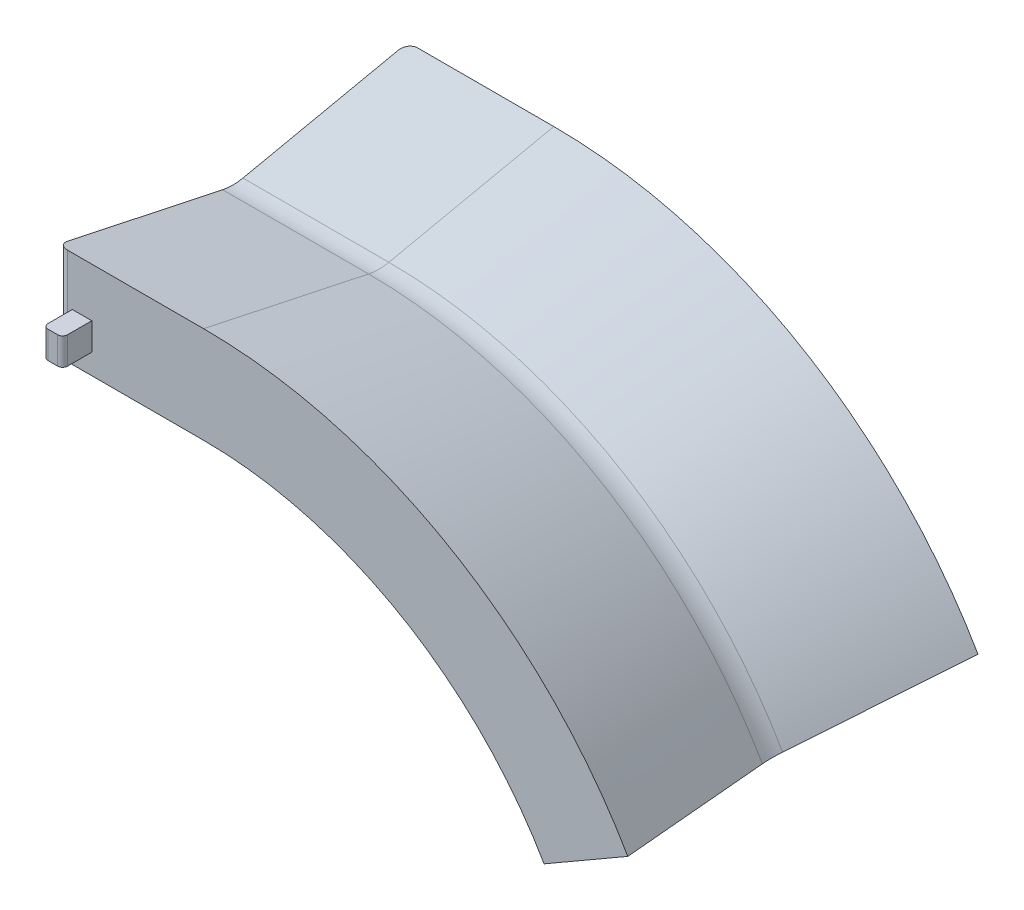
from build123d import *

# Parameters (mm, degrees)
FILLET_1_R      = 1
EXTRUDE_2_DEPTH = 2.8


with BuildPart() as part:
    # Sweep 1: sweep along a path in Sketch 2
    with BuildLine(Plane.XY) as sweep_1_path:
        Line((0, 0), (15, 0))
        ThreePointArc((15, 0), (35.207259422, -5.414518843), (50, -20.207259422))
    # Sketch 1 → Sweep 1 (sweep)
    with BuildSketch(Plane(origin=(0, 0, 0), x_dir=(0, 0, -1), z_dir=(1, 0, 0))):
        with BuildLine():
            Line((-18, 0), (18, 0))
            Line((18, 0), (18, 9.939299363))
            Line((18, 9.939299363), (1.040411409, 6.33133593))
            ThreePointArc((1.040411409, 6.33133593), (0, 6.221892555), (-1.040411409, 6.33133593))
            Line((-1.040411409, 6.33133593), (-18, 9.939299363))
            Line((-18, 9.939299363), (-18, 0))
        make_face()
    sweep(path=sweep_1_path.line)

    # Fillet 1
    fillet_1_edges = [part.edges().sort_by_distance(p)[0] for p in [
        (0, 4.969649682, -18),
        (0, 4.969649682, 18),
    ]]
    fillet(fillet_1_edges, radius=FILLET_1_R)

    # Sketch 4 → Extrude 2 (add)
    with BuildSketch(Plane(origin=(0, 4.9, 0), x_dir=(1, 0, 0), z_dir=(0, 1, 0))):
        with BuildLine():
            Line((1.5, -18), (1.5, -20.5))
            ThreePointArc((1.5, -20.5), (1.646446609, -20.853553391), (2, -21))
            Line((2, -21), (3, -21))
            ThreePointArc((3, -21), (3.353553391, -20.853553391), (3.5, -20.5))
            Line((3.5, -20.5), (3.5, -18))
            Line((3.5, -18), (1.5, -18))
        make_face()
    extrude_2 = extrude(amount=-EXTRUDE_2_DEPTH)

    # Mirror 1: Extrude 2 across plane
    add(extrude_2.mirror(Plane.XY))


solid = part.part
